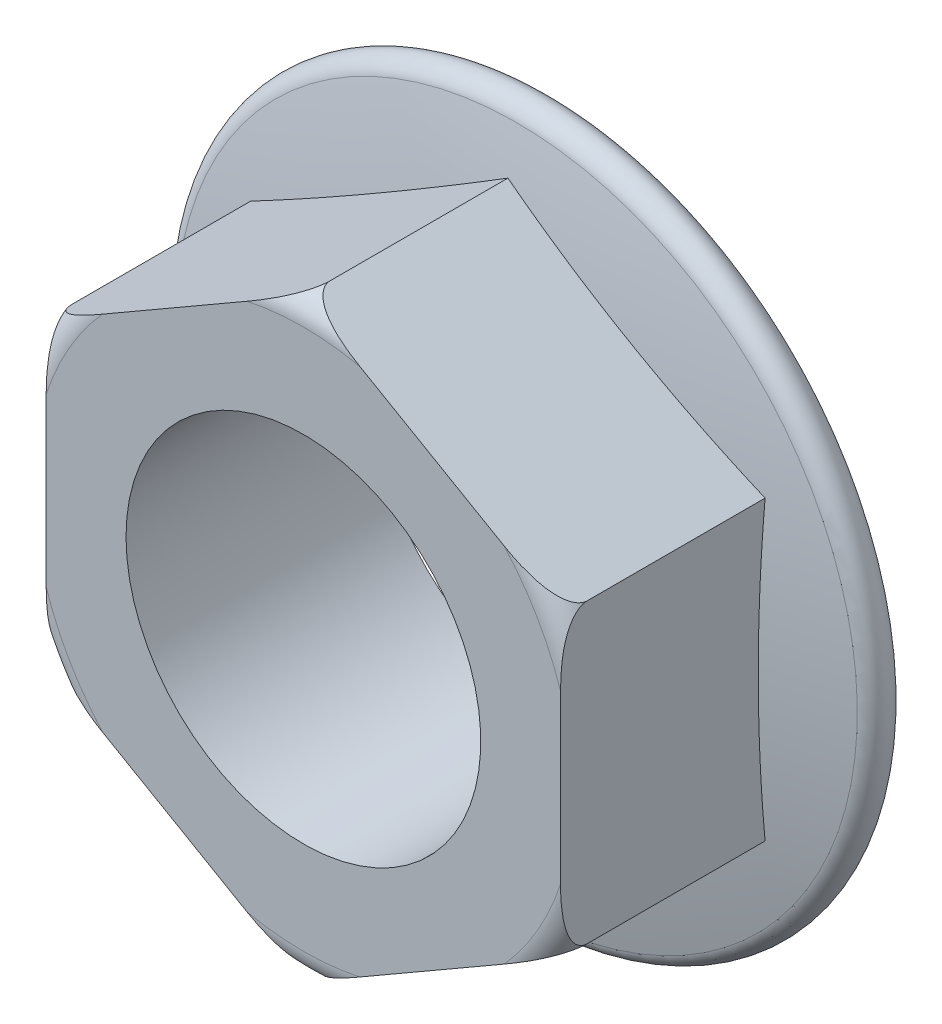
from build123d import *

# Parameters (mm, degrees)
HEAD_DEPTH              = 28
ESQUISSE1_R             = 20
ENL_V_MAT_EXTRU_1_DEPTH = 64.118935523


with BuildPart() as part:
    # Head Sketch → Head (new body)
    with BuildSketch(Plane.XY):
        Polygon((0, 33.486315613), (29, 16.743157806), (29, -16.743157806), (0, -33.486315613), (-29, -16.743157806), (-29, 16.743157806), align=None)
    extrude(amount=HEAD_DEPTH)

    # Flange Sketch → Flange (revolve)
    with BuildSketch(Plane(origin=(0, 0, 0), x_dir=(-1, 0, 0), z_dir=(0, 1, 0)), mode=Mode.PRIVATE) as flange_sk:
        with BuildLine():
            Line((-38, 0), (0, 0))
            Line((0, 0), (0, 8))
            ThreePointArc((0, 8), (-19.314342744, 6.986256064), (-38.416438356, 3.956164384))
            ThreePointArc((-38.416438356, 3.956164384), (-39.989010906, 1.790630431), (-38, 0))
        make_face()
    revolve(flange_sk.sketch.rotate(Axis((0, 0, 1.843425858), (0, 0, 1)), 30), axis=Axis((0, 0, 1.843425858), (0, 0, 1)))

    # Sketch5 → Head Trim (revolve, cut)
    with BuildSketch(Plane(origin=(0, 0, 0), x_dir=(0, 0, -1), z_dir=(1, 0, 0)), mode=Mode.PRIVATE) as head_trim_sk:
        with BuildLine():
            Line((-28, -30.486315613), (-28, -33.486315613))
            Line((-28, -33.486315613), (-25, -33.486315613))
            ThreePointArc((-25, -33.486315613), (-27.121320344, -32.607635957), (-28, -30.486315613))
        make_face()
    revolve(head_trim_sk.sketch.rotate(Axis((0, 0, 15.085599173), (0, 0, -1)), 90), axis=Axis((0, 0, 15.085599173), (0, 0, -1)), mode=Mode.SUBTRACT)

    # Esquisse1 → Enl_v. mat.-Extru.1 (cut, through all)
    with BuildSketch(Plane(origin=(0, 0, 0), x_dir=(-1, 0, 0), z_dir=(0, 0, -1))):
        Circle(ESQUISSE1_R)
    extrude(amount=-ENL_V_MAT_EXTRU_1_DEPTH, mode=Mode.SUBTRACT)


solid = part.part
